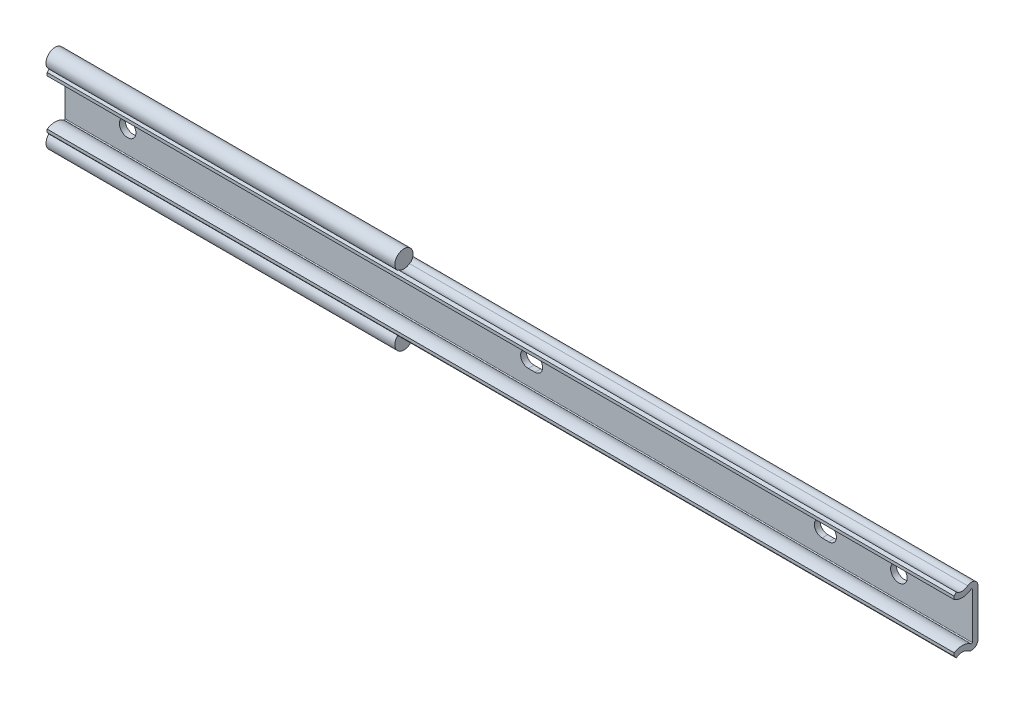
ISO-10303-21;
HEADER;
FILE_DESCRIPTION(('STEP AP214'),'2;1');
FILE_NAME('part.step','',(''),(''),'','','');
FILE_SCHEMA(('AUTOMOTIVE_DESIGN { 1 0 10303 214 1 1 1 1 }'));
ENDSEC;
DATA;
#1=APPLICATION_CONTEXT('core data for automotive mechanical design processes');
#2=APPLICATION_PROTOCOL_DEFINITION('international standard','automotive_design',2000,#1);
#3=PRODUCT_CONTEXT('',#1,'mechanical');
#4=PRODUCT('Part','Part','',(#3));
#5=PRODUCT_RELATED_PRODUCT_CATEGORY('part','',(#4));
#6=PRODUCT_DEFINITION_FORMATION('','',#4);
#7=PRODUCT_DEFINITION_CONTEXT('part definition',#1,'design');
#8=PRODUCT_DEFINITION('design','',#6,#7);
#9=PRODUCT_DEFINITION_SHAPE('','',#8);
#10=(LENGTH_UNIT() NAMED_UNIT(*) SI_UNIT(.MILLI.,.METRE.));
#11=(NAMED_UNIT(*) PLANE_ANGLE_UNIT() SI_UNIT($,.RADIAN.));
#12=(NAMED_UNIT(*) SI_UNIT($,.STERADIAN.) SOLID_ANGLE_UNIT());
#13=UNCERTAINTY_MEASURE_WITH_UNIT(LENGTH_MEASURE(1.E-05),#10,'distance_accuracy_value','');
#14=(GEOMETRIC_REPRESENTATION_CONTEXT(3) GLOBAL_UNCERTAINTY_ASSIGNED_CONTEXT((#13)) GLOBAL_UNIT_ASSIGNED_CONTEXT((#10,
#11,#12)) REPRESENTATION_CONTEXT('',''));
#15=CARTESIAN_POINT('',(0.,0.,0.));
#16=DIRECTION('',(0.,0.,1.));
#17=DIRECTION('',(1.,0.,0.));
#18=AXIS2_PLACEMENT_3D('',#15,#16,#17);
#19=CARTESIAN_POINT('',(230.,9.66999972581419,4.3099999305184));
#20=DIRECTION('',(-1.,0.,0.));
#21=DIRECTION('',(0.,0.,1.));
#22=AXIS2_PLACEMENT_3D('',#19,#20,#21);
#23=CYLINDRICAL_SURFACE('',#22,2.48000011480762);
#24=CARTESIAN_POINT('',(78.,9.66999972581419,4.3099999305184));
#25=DIRECTION('',(-1.,0.,0.));
#26=DIRECTION('',(0.,0.,1.));
#27=AXIS2_PLACEMENT_3D('',#24,#25,#26);
#28=CIRCLE('',#27,2.48000011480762);
#29=CARTESIAN_POINT('',(78.,7.77020940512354,5.90411325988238));
#30=VERTEX_POINT('',#29);
#31=CARTESIAN_POINT('',(78.,7.69573912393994,2.80910165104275));
#32=VERTEX_POINT('',#31);
#33=EDGE_CURVE('E228',#30,#32,#28,.F.);
#34=ORIENTED_EDGE('',*,*,#33,.F.);
#35=DIRECTION('',(-1.,0.,0.));
#36=VECTOR('',#35,1.);
#37=CARTESIAN_POINT('',(230.,7.77020940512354,5.90411325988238));
#38=LINE('',#37,#36);
#39=CARTESIAN_POINT('',(230.,7.77020940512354,5.90411325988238));
#40=VERTEX_POINT('',#39);
#41=EDGE_CURVE('E350',#40,#30,#38,.T.);
#42=ORIENTED_EDGE('',*,*,#41,.F.);
#43=CARTESIAN_POINT('',(230.,9.66999972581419,4.3099999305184));
#44=DIRECTION('',(-1.,0.,0.));
#45=DIRECTION('',(0.,0.,-1.));
#46=AXIS2_PLACEMENT_3D('',#43,#44,#45);
#47=CIRCLE('',#46,2.48000011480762);
#48=CARTESIAN_POINT('',(230.,7.69573912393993,2.80910165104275));
#49=VERTEX_POINT('',#48);
#50=EDGE_CURVE('E324',#49,#40,#47,.T.);
#51=ORIENTED_EDGE('',*,*,#50,.F.);
#52=DIRECTION('',(-1.,0.,0.));
#53=VECTOR('',#52,1.);
#54=CARTESIAN_POINT('',(230.,7.69573912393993,2.80910165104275));
#55=LINE('',#54,#53);
#56=EDGE_CURVE('E353',#49,#32,#55,.T.);
#57=ORIENTED_EDGE('',*,*,#56,.T.);
#58=EDGE_LOOP('',(#34,#42,#51,#57));
#59=FACE_BOUND('',#58,.T.);
#60=ADVANCED_FACE('F14',(#59),#23,.F.);
#61=CARTESIAN_POINT('',(230.,-9.66999990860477,4.3099999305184));
#62=DIRECTION('',(-1.,0.,0.));
#63=DIRECTION('',(0.,0.,1.));
#64=AXIS2_PLACEMENT_3D('',#61,#62,#63);
#65=CYLINDRICAL_SURFACE('',#64,4.03000011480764);
#66=DIRECTION('',(-1.,0.,0.));
#67=VECTOR('',#66,1.);
#68=CARTESIAN_POINT('',(230.,-6.46182654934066,1.87104018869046));
#69=LINE('',#68,#67);
#70=CARTESIAN_POINT('',(230.,-6.46182654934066,1.87104018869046));
#71=VERTEX_POINT('',#70);
#72=CARTESIAN_POINT('',(-17.,-6.46182654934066,1.87104018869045));
#73=VERTEX_POINT('',#72);
#74=EDGE_CURVE('E338',#71,#73,#69,.T.);
#75=ORIENTED_EDGE('',*,*,#74,.T.);
#76=CARTESIAN_POINT('',(-17.,-9.66999990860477,4.3099999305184));
#77=DIRECTION('',(-1.,0.,0.));
#78=DIRECTION('',(0.,0.,1.));
#79=AXIS2_PLACEMENT_3D('',#76,#77,#78);
#80=CIRCLE('',#79,4.03000011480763);
#81=CARTESIAN_POINT('',(-17.,-6.26775055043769,6.4699999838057));
#82=VERTEX_POINT('',#81);
#83=EDGE_CURVE('E232',#82,#73,#80,.T.);
#84=ORIENTED_EDGE('',*,*,#83,.F.);
#85=DIRECTION('',(-1.,0.,0.));
#86=VECTOR('',#85,1.);
#87=CARTESIAN_POINT('',(230.,-6.26775055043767,6.46999998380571));
#88=LINE('',#87,#86);
#89=CARTESIAN_POINT('',(230.,-6.26775055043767,6.46999998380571));
#90=VERTEX_POINT('',#89);
#91=EDGE_CURVE('E368',#90,#82,#88,.T.);
#92=ORIENTED_EDGE('',*,*,#91,.F.);
#93=CARTESIAN_POINT('',(230.,-9.66999990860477,4.3099999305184));
#94=DIRECTION('',(1.,0.,0.));
#95=DIRECTION('',(0.,0.,1.));
#96=AXIS2_PLACEMENT_3D('',#93,#94,#95);
#97=CIRCLE('',#96,4.03000011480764);
#98=EDGE_CURVE('E309',#71,#90,#97,.T.);
#99=ORIENTED_EDGE('',*,*,#98,.F.);
#100=EDGE_LOOP('',(#75,#84,#92,#99));
#101=FACE_BOUND('',#100,.T.);
#102=ADVANCED_FACE('F16',(#101),#65,.T.);
#103=CARTESIAN_POINT('',(230.,-6.26775055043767,6.46999998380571));
#104=DIRECTION('',(0.,0.,-1.));
#105=DIRECTION('',(-1.,0.,0.));
#106=AXIS2_PLACEMENT_3D('',#103,#104,#105);
#107=PLANE('',#106);
#108=ORIENTED_EDGE('',*,*,#91,.T.);
#109=DIRECTION('',(0.,1.,0.));
#110=VECTOR('',#109,1.);
#111=CARTESIAN_POINT('',(-17.,-7.09581181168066,6.46999998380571));
#112=LINE('',#111,#110);
#113=CARTESIAN_POINT('',(-17.,-7.09581181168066,6.46999998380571));
#114=VERTEX_POINT('',#113);
#115=EDGE_CURVE('E262',#114,#82,#112,.T.);
#116=ORIENTED_EDGE('',*,*,#115,.F.);
#117=DIRECTION('',(-1.,0.,0.));
#118=VECTOR('',#117,1.);
#119=CARTESIAN_POINT('',(230.,-7.09581181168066,6.46999998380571));
#120=LINE('',#119,#118);
#121=CARTESIAN_POINT('',(230.,-7.09581181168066,6.46999998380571));
#122=VERTEX_POINT('',#121);
#123=EDGE_CURVE('E366',#122,#114,#120,.T.);
#124=ORIENTED_EDGE('',*,*,#123,.F.);
#125=DIRECTION('',(0.,-1.,0.));
#126=VECTOR('',#125,1.);
#127=CARTESIAN_POINT('',(230.,-6.26775055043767,6.46999998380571));
#128=LINE('',#127,#126);
#129=EDGE_CURVE('E312',#90,#122,#128,.T.);
#130=ORIENTED_EDGE('',*,*,#129,.F.);
#131=EDGE_LOOP('',(#108,#116,#124,#130));
#132=FACE_BOUND('',#131,.T.);
#133=ADVANCED_FACE('F456',(#132),#107,.F.);
#134=CARTESIAN_POINT('',(230.,-7.77020958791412,5.90411325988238));
#135=DIRECTION('',(0.,0.642787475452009,-0.766044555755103));
#136=DIRECTION('',(0.,0.766044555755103,0.642787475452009));
#137=AXIS2_PLACEMENT_3D('',#134,#135,#136);
#138=PLANE('',#137);
#139=DIRECTION('',(0.,0.7660445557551,0.642787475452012));
#140=VECTOR('',#139,1.);
#141=CARTESIAN_POINT('',(-17.,-7.77020958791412,5.90411325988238));
#142=LINE('',#141,#140);
#143=CARTESIAN_POINT('',(-17.,-7.65539913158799,6.00045063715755));
#144=VERTEX_POINT('',#143);
#145=EDGE_CURVE('E211',#144,#114,#142,.T.);
#146=ORIENTED_EDGE('',*,*,#145,.F.);
#147=DIRECTION('',(-1.,0.,0.));
#148=VECTOR('',#147,1.);
#149=CARTESIAN_POINT('',(78.,-7.65539913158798,6.00045063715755));
#150=LINE('',#149,#148);
#151=CARTESIAN_POINT('',(78.,-7.65539913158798,6.00045063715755));
#152=VERTEX_POINT('',#151);
#153=EDGE_CURVE('E202',#144,#152,#150,.F.);
#154=ORIENTED_EDGE('',*,*,#153,.T.);
#155=DIRECTION('',(0.,-0.766044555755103,-0.642787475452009));
#156=VECTOR('',#155,1.);
#157=CARTESIAN_POINT('',(78.,-7.77020958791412,5.90411325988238));
#158=LINE('',#157,#156);
#159=CARTESIAN_POINT('',(78.,-7.77020958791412,5.90411325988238));
#160=VERTEX_POINT('',#159);
#161=EDGE_CURVE('E188',#152,#160,#158,.T.);
#162=ORIENTED_EDGE('',*,*,#161,.T.);
#163=DIRECTION('',(-1.,0.,0.));
#164=VECTOR('',#163,1.);
#165=CARTESIAN_POINT('',(230.,-7.77020958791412,5.90411325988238));
#166=LINE('',#165,#164);
#167=CARTESIAN_POINT('',(230.,-7.77020958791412,5.90411325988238));
#168=VERTEX_POINT('',#167);
#169=EDGE_CURVE('E364',#168,#160,#166,.T.);
#170=ORIENTED_EDGE('',*,*,#169,.F.);
#171=DIRECTION('',(0.,-0.766044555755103,-0.642787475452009));
#172=VECTOR('',#171,1.);
#173=CARTESIAN_POINT('',(230.,-7.77020958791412,5.90411325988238));
#174=LINE('',#173,#172);
#175=EDGE_CURVE('E314',#122,#168,#174,.T.);
#176=ORIENTED_EDGE('',*,*,#175,.F.);
#177=ORIENTED_EDGE('',*,*,#123,.T.);
#178=EDGE_LOOP('',(#146,#154,#162,#170,#176,#177));
#179=FACE_BOUND('',#178,.T.);
#180=ADVANCED_FACE('F209',(#179),#138,.F.);
#181=CARTESIAN_POINT('',(230.,-9.66999990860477,4.3099999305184));
#182=DIRECTION('',(-1.,0.,0.));
#183=DIRECTION('',(0.,0.,1.));
#184=AXIS2_PLACEMENT_3D('',#181,#182,#183);
#185=CYLINDRICAL_SURFACE('',#184,2.48000011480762);
#186=ORIENTED_EDGE('',*,*,#169,.T.);
#187=CARTESIAN_POINT('',(78.,-9.66999990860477,4.3099999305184));
#188=DIRECTION('',(1.,0.,0.));
#189=DIRECTION('',(0.,0.,-1.));
#190=AXIS2_PLACEMENT_3D('',#187,#188,#189);
#191=CIRCLE('',#190,2.48000011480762);
#192=CARTESIAN_POINT('',(78.,-7.69573930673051,2.80910165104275));
#193=VERTEX_POINT('',#192);
#194=EDGE_CURVE('E193',#160,#193,#191,.F.);
#195=ORIENTED_EDGE('',*,*,#194,.T.);
#196=DIRECTION('',(-1.,0.,0.));
#197=VECTOR('',#196,1.);
#198=CARTESIAN_POINT('',(230.,-7.69573930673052,2.80910165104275));
#199=LINE('',#198,#197);
#200=CARTESIAN_POINT('',(230.,-7.69573930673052,2.80910165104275));
#201=VERTEX_POINT('',#200);
#202=EDGE_CURVE('E361',#201,#193,#199,.T.);
#203=ORIENTED_EDGE('',*,*,#202,.F.);
#204=CARTESIAN_POINT('',(230.,-9.66999990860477,4.3099999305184));
#205=DIRECTION('',(-1.,0.,0.));
#206=DIRECTION('',(0.,0.,1.));
#207=AXIS2_PLACEMENT_3D('',#204,#205,#206);
#208=CIRCLE('',#207,2.48000011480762);
#209=EDGE_CURVE('E316',#168,#201,#208,.T.);
#210=ORIENTED_EDGE('',*,*,#209,.F.);
#211=EDGE_LOOP('',(#186,#195,#203,#210));
#212=FACE_BOUND('',#211,.T.);
#213=ADVANCED_FACE('F463',(#212),#185,.F.);
#214=CARTESIAN_POINT('',(230.,-6.302612,1.74999999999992));
#215=DIRECTION('',(-1.,0.,0.));
#216=DIRECTION('',(0.,0.,1.));
#217=AXIS2_PLACEMENT_3D('',#214,#215,#216);
#218=CYLINDRICAL_SURFACE('',#217,1.74999999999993);
#219=CARTESIAN_POINT('',(78.,-6.302612,1.74999999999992));
#220=DIRECTION('',(1.,0.,0.));
#221=DIRECTION('',(0.,0.,-1.));
#222=AXIS2_PLACEMENT_3D('',#219,#220,#221);
#223=CIRCLE('',#222,1.74999999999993);
#224=CARTESIAN_POINT('',(78.,-7.94495173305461,2.35433451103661));
#225=VERTEX_POINT('',#224);
#226=EDGE_CURVE('E9',#193,#225,#223,.T.);
#227=ORIENTED_EDGE('',*,*,#226,.T.);
#228=DIRECTION('',(-1.,0.,0.));
#229=VECTOR('',#228,1.);
#230=CARTESIAN_POINT('',(30.5,-7.94495173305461,2.35433451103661));
#231=LINE('',#230,#229);
#232=CARTESIAN_POINT('',(-17.,-7.94495173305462,2.3543345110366));
#233=VERTEX_POINT('',#232);
#234=EDGE_CURVE('E205',#225,#233,#231,.T.);
#235=ORIENTED_EDGE('',*,*,#234,.T.);
#236=CARTESIAN_POINT('',(-17.,-6.302612,1.74999999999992));
#237=DIRECTION('',(-1.,0.,0.));
#238=DIRECTION('',(0.,0.,1.));
#239=AXIS2_PLACEMENT_3D('',#236,#237,#238);
#240=CIRCLE('',#239,1.74999999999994);
#241=CARTESIAN_POINT('',(-17.,-6.302612,0.));
#242=VERTEX_POINT('',#241);
#243=EDGE_CURVE('E258',#242,#233,#240,.T.);
#244=ORIENTED_EDGE('',*,*,#243,.F.);
#245=DIRECTION('',(-1.,0.,0.));
#246=VECTOR('',#245,1.);
#247=CARTESIAN_POINT('',(230.,-6.302612,0.));
#248=LINE('',#247,#246);
#249=CARTESIAN_POINT('',(230.,-6.302612,0.));
#250=VERTEX_POINT('',#249);
#251=EDGE_CURVE('E359',#250,#242,#248,.T.);
#252=ORIENTED_EDGE('',*,*,#251,.F.);
#253=CARTESIAN_POINT('',(230.,-6.302612,1.74999999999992));
#254=DIRECTION('',(1.,0.,0.));
#255=DIRECTION('',(0.,0.,1.));
#256=AXIS2_PLACEMENT_3D('',#253,#254,#255);
#257=CIRCLE('',#256,1.74999999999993);
#258=EDGE_CURVE('E318',#201,#250,#257,.T.);
#259=ORIENTED_EDGE('',*,*,#258,.F.);
#260=ORIENTED_EDGE('',*,*,#202,.T.);
#261=EDGE_LOOP('',(#227,#235,#244,#252,#259,#260));
#262=FACE_BOUND('',#261,.T.);
#263=ADVANCED_FACE('F465',(#262),#218,.T.);
#264=CARTESIAN_POINT('',(230.,-6.302612,0.));
#265=DIRECTION('',(0.,0.,1.));
#266=DIRECTION('',(1.,0.,0.));
#267=AXIS2_PLACEMENT_3D('',#264,#265,#266);
#268=PLANE('',#267);
#269=DIRECTION('',(-1.,0.,0.));
#270=VECTOR('',#269,1.);
#271=CARTESIAN_POINT('',(110.9,-2.1,0.));
#272=LINE('',#271,#270);
#273=CARTESIAN_POINT('',(110.9,-2.1,0.));
#274=VERTEX_POINT('',#273);
#275=CARTESIAN_POINT('',(109.1,-2.1,0.));
#276=VERTEX_POINT('',#275);
#277=EDGE_CURVE('E266',#274,#276,#272,.T.);
#278=ORIENTED_EDGE('',*,*,#277,.F.);
#279=CARTESIAN_POINT('',(110.9,0.,0.));
#280=DIRECTION('',(0.,0.,-1.));
#281=DIRECTION('',(-1.,0.,0.));
#282=AXIS2_PLACEMENT_3D('',#279,#280,#281);
#283=CIRCLE('',#282,2.1);
#284=CARTESIAN_POINT('',(110.9,2.1,0.));
#285=VERTEX_POINT('',#284);
#286=EDGE_CURVE('E29',#285,#274,#283,.T.);
#287=ORIENTED_EDGE('',*,*,#286,.F.);
#288=DIRECTION('',(1.,0.,0.));
#289=VECTOR('',#288,1.);
#290=CARTESIAN_POINT('',(110.9,2.1,0.));
#291=LINE('',#290,#289);
#292=CARTESIAN_POINT('',(109.1,2.1,0.));
#293=VERTEX_POINT('',#292);
#294=EDGE_CURVE('E271',#293,#285,#291,.T.);
#295=ORIENTED_EDGE('',*,*,#294,.F.);
#296=CARTESIAN_POINT('',(109.1,0.,0.));
#297=DIRECTION('',(0.,0.,-1.));
#298=DIRECTION('',(-1.,0.,0.));
#299=AXIS2_PLACEMENT_3D('',#296,#297,#298);
#300=CIRCLE('',#299,2.1);
#301=EDGE_CURVE('E268',#276,#293,#300,.T.);
#302=ORIENTED_EDGE('',*,*,#301,.F.);
#303=EDGE_LOOP('',(#278,#287,#295,#302));
#304=FACE_BOUND('',#303,.T.);
#305=DIRECTION('',(-1.,0.,0.));
#306=VECTOR('',#305,1.);
#307=CARTESIAN_POINT('',(190.9,-2.1,0.));
#308=LINE('',#307,#306);
#309=CARTESIAN_POINT('',(190.9,-2.1,0.));
#310=VERTEX_POINT('',#309);
#311=CARTESIAN_POINT('',(189.1,-2.1,0.));
#312=VERTEX_POINT('',#311);
#313=EDGE_CURVE('E283',#310,#312,#308,.T.);
#314=ORIENTED_EDGE('',*,*,#313,.F.);
#315=CARTESIAN_POINT('',(190.9,0.,0.));
#316=DIRECTION('',(0.,0.,-1.));
#317=DIRECTION('',(-1.,0.,0.));
#318=AXIS2_PLACEMENT_3D('',#315,#316,#317);
#319=CIRCLE('',#318,2.1);
#320=CARTESIAN_POINT('',(190.9,2.1,0.));
#321=VERTEX_POINT('',#320);
#322=EDGE_CURVE('E277',#321,#310,#319,.T.);
#323=ORIENTED_EDGE('',*,*,#322,.F.);
#324=DIRECTION('',(1.,0.,0.));
#325=VECTOR('',#324,1.);
#326=CARTESIAN_POINT('',(190.9,2.1,0.));
#327=LINE('',#326,#325);
#328=CARTESIAN_POINT('',(189.1,2.1,0.));
#329=VERTEX_POINT('',#328);
#330=EDGE_CURVE('E289',#329,#321,#327,.T.);
#331=ORIENTED_EDGE('',*,*,#330,.F.);
#332=CARTESIAN_POINT('',(189.1,0.,0.));
#333=DIRECTION('',(0.,0.,-1.));
#334=DIRECTION('',(-1.,0.,0.));
#335=AXIS2_PLACEMENT_3D('',#332,#333,#334);
#336=CIRCLE('',#335,2.1);
#337=EDGE_CURVE('E286',#312,#329,#336,.T.);
#338=ORIENTED_EDGE('',*,*,#337,.F.);
#339=EDGE_LOOP('',(#314,#323,#331,#338));
#340=FACE_BOUND('',#339,.T.);
#341=CARTESIAN_POINT('',(210.,0.,0.));
#342=DIRECTION('',(0.,0.,-1.));
#343=DIRECTION('',(-1.,0.,0.));
#344=AXIS2_PLACEMENT_3D('',#341,#342,#343);
#345=CIRCLE('',#344,2.25);
#346=CARTESIAN_POINT('',(207.75,0.,0.));
#347=VERTEX_POINT('',#346);
#348=EDGE_CURVE('E295',#347,#347,#345,.T.);
#349=ORIENTED_EDGE('',*,*,#348,.F.);
#350=EDGE_LOOP('',(#349));
#351=FACE_BOUND('',#350,.T.);
#352=CARTESIAN_POINT('',(0.,0.,0.));
#353=DIRECTION('',(0.,0.,-1.));
#354=DIRECTION('',(-1.,0.,0.));
#355=AXIS2_PLACEMENT_3D('',#352,#353,#354);
#356=CIRCLE('',#355,2.24999999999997);
#357=CARTESIAN_POINT('',(-2.24999999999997,0.,0.));
#358=VERTEX_POINT('',#357);
#359=EDGE_CURVE('E305',#358,#358,#356,.T.);
#360=ORIENTED_EDGE('',*,*,#359,.F.);
#361=EDGE_LOOP('',(#360));
#362=FACE_BOUND('',#361,.T.);
#363=ORIENTED_EDGE('',*,*,#251,.T.);
#364=DIRECTION('',(0.,-1.,0.));
#365=VECTOR('',#364,1.);
#366=CARTESIAN_POINT('',(-17.,6.30261181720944,0.));
#367=LINE('',#366,#365);
#368=CARTESIAN_POINT('',(-17.,6.30261181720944,0.));
#369=VERTEX_POINT('',#368);
#370=EDGE_CURVE('E255',#369,#242,#367,.T.);
#371=ORIENTED_EDGE('',*,*,#370,.F.);
#372=DIRECTION('',(-1.,0.,0.));
#373=VECTOR('',#372,1.);
#374=CARTESIAN_POINT('',(230.,6.30261181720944,0.));
#375=LINE('',#374,#373);
#376=CARTESIAN_POINT('',(230.,6.30261181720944,0.));
#377=VERTEX_POINT('',#376);
#378=EDGE_CURVE('E356',#377,#369,#375,.T.);
#379=ORIENTED_EDGE('',*,*,#378,.F.);
#380=DIRECTION('',(0.,1.,0.));
#381=VECTOR('',#380,1.);
#382=CARTESIAN_POINT('',(230.,-6.302612,0.));
#383=LINE('',#382,#381);
#384=EDGE_CURVE('E320',#250,#377,#383,.T.);
#385=ORIENTED_EDGE('',*,*,#384,.F.);
#386=EDGE_LOOP('',(#363,#371,#379,#385));
#387=FACE_BOUND('',#386,.T.);
#388=ADVANCED_FACE('F469',(#304,#340,#351,#362,#387),#268,.F.);
#389=CARTESIAN_POINT('',(230.,6.30261181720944,1.74999999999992));
#390=DIRECTION('',(-1.,0.,0.));
#391=DIRECTION('',(0.,0.,1.));
#392=AXIS2_PLACEMENT_3D('',#389,#390,#391);
#393=CYLINDRICAL_SURFACE('',#392,1.74999999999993);
#394=CARTESIAN_POINT('',(-17.,6.30261181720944,1.74999999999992));
#395=DIRECTION('',(-1.,0.,0.));
#396=DIRECTION('',(0.,0.,1.));
#397=AXIS2_PLACEMENT_3D('',#394,#395,#396);
#398=CIRCLE('',#397,1.74999999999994);
#399=CARTESIAN_POINT('',(-17.,7.94495155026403,2.3543345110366));
#400=VERTEX_POINT('',#399);
#401=EDGE_CURVE('E253',#400,#369,#398,.T.);
#402=ORIENTED_EDGE('',*,*,#401,.F.);
#403=DIRECTION('',(-1.,0.,0.));
#404=VECTOR('',#403,1.);
#405=CARTESIAN_POINT('',(30.5,7.94495155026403,2.35433451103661));
#406=LINE('',#405,#404);
#407=CARTESIAN_POINT('',(78.,7.94495155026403,2.35433451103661));
#408=VERTEX_POINT('',#407);
#409=EDGE_CURVE('E225',#400,#408,#406,.F.);
#410=ORIENTED_EDGE('',*,*,#409,.T.);
#411=CARTESIAN_POINT('',(78.,6.30261181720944,1.74999999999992));
#412=DIRECTION('',(-1.,0.,0.));
#413=DIRECTION('',(0.,0.,1.));
#414=AXIS2_PLACEMENT_3D('',#411,#412,#413);
#415=CIRCLE('',#414,1.74999999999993);
#416=EDGE_CURVE('E230',#32,#408,#415,.T.);
#417=ORIENTED_EDGE('',*,*,#416,.F.);
#418=ORIENTED_EDGE('',*,*,#56,.F.);
#419=CARTESIAN_POINT('',(230.,6.30261181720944,1.74999999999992));
#420=DIRECTION('',(1.,0.,0.));
#421=DIRECTION('',(0.,0.,-1.));
#422=AXIS2_PLACEMENT_3D('',#419,#420,#421);
#423=CIRCLE('',#422,1.74999999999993);
#424=EDGE_CURVE('E322',#377,#49,#423,.T.);
#425=ORIENTED_EDGE('',*,*,#424,.F.);
#426=ORIENTED_EDGE('',*,*,#378,.T.);
#427=EDGE_LOOP('',(#402,#410,#417,#418,#425,#426));
#428=FACE_BOUND('',#427,.T.);
#429=ADVANCED_FACE('F421',(#428),#393,.T.);
#430=CARTESIAN_POINT('',(230.,7.77020940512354,5.90411325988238));
#431=DIRECTION('',(0.,-0.642787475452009,-0.766044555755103));
#432=DIRECTION('',(0.,0.766044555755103,-0.642787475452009));
#433=AXIS2_PLACEMENT_3D('',#430,#431,#432);
#434=PLANE('',#433);
#435=DIRECTION('',(0.,0.766044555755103,-0.642787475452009));
#436=VECTOR('',#435,1.);
#437=CARTESIAN_POINT('',(78.,7.77020940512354,5.90411325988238));
#438=LINE('',#437,#436);
#439=CARTESIAN_POINT('',(78.,7.6553989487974,6.00045063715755));
#440=VERTEX_POINT('',#439);
#441=EDGE_CURVE('E22',#440,#30,#438,.T.);
#442=ORIENTED_EDGE('',*,*,#441,.F.);
#443=DIRECTION('',(-1.,0.,0.));
#444=VECTOR('',#443,1.);
#445=CARTESIAN_POINT('',(78.,7.6553989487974,6.00045063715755));
#446=LINE('',#445,#444);
#447=CARTESIAN_POINT('',(-17.,7.6553989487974,6.00045063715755));
#448=VERTEX_POINT('',#447);
#449=EDGE_CURVE('E220',#440,#448,#446,.T.);
#450=ORIENTED_EDGE('',*,*,#449,.T.);
#451=DIRECTION('',(0.,0.7660445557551,-0.642787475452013));
#452=VECTOR('',#451,1.);
#453=CARTESIAN_POINT('',(-17.,7.09581162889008,6.46999998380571));
#454=LINE('',#453,#452);
#455=CARTESIAN_POINT('',(-17.,7.09581162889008,6.46999998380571));
#456=VERTEX_POINT('',#455);
#457=EDGE_CURVE('E250',#456,#448,#454,.T.);
#458=ORIENTED_EDGE('',*,*,#457,.F.);
#459=DIRECTION('',(-1.,0.,0.));
#460=VECTOR('',#459,1.);
#461=CARTESIAN_POINT('',(230.,7.09581162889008,6.46999998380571));
#462=LINE('',#461,#460);
#463=CARTESIAN_POINT('',(230.,7.09581162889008,6.46999998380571));
#464=VERTEX_POINT('',#463);
#465=EDGE_CURVE('E348',#464,#456,#462,.T.);
#466=ORIENTED_EDGE('',*,*,#465,.F.);
#467=DIRECTION('',(0.,-0.766044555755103,0.642787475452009));
#468=VECTOR('',#467,1.);
#469=CARTESIAN_POINT('',(230.,7.77020940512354,5.90411325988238));
#470=LINE('',#469,#468);
#471=EDGE_CURVE('E326',#40,#464,#470,.T.);
#472=ORIENTED_EDGE('',*,*,#471,.F.);
#473=ORIENTED_EDGE('',*,*,#41,.T.);
#474=EDGE_LOOP('',(#442,#450,#458,#466,#472,#473));
#475=FACE_BOUND('',#474,.T.);
#476=ADVANCED_FACE('F409',(#475),#434,.F.);
#477=CARTESIAN_POINT('',(230.,6.26775036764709,6.46999998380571));
#478=DIRECTION('',(0.,0.,-1.));
#479=DIRECTION('',(-1.,0.,0.));
#480=AXIS2_PLACEMENT_3D('',#477,#478,#479);
#481=PLANE('',#480);
#482=ORIENTED_EDGE('',*,*,#465,.T.);
#483=DIRECTION('',(0.,1.,0.));
#484=VECTOR('',#483,1.);
#485=CARTESIAN_POINT('',(-17.,6.26775036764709,6.46999998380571));
#486=LINE('',#485,#484);
#487=CARTESIAN_POINT('',(-17.,6.26775036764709,6.46999998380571));
#488=VERTEX_POINT('',#487);
#489=EDGE_CURVE('E247',#488,#456,#486,.T.);
#490=ORIENTED_EDGE('',*,*,#489,.F.);
#491=DIRECTION('',(-1.,0.,0.));
#492=VECTOR('',#491,1.);
#493=CARTESIAN_POINT('',(230.,6.26775036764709,6.46999998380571));
#494=LINE('',#493,#492);
#495=CARTESIAN_POINT('',(230.,6.26775036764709,6.46999998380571));
#496=VERTEX_POINT('',#495);
#497=EDGE_CURVE('E346',#496,#488,#494,.T.);
#498=ORIENTED_EDGE('',*,*,#497,.F.);
#499=DIRECTION('',(0.,-1.,0.));
#500=VECTOR('',#499,1.);
#501=CARTESIAN_POINT('',(230.,6.26775036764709,6.46999998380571));
#502=LINE('',#501,#500);
#503=EDGE_CURVE('E328',#464,#496,#502,.T.);
#504=ORIENTED_EDGE('',*,*,#503,.F.);
#505=EDGE_LOOP('',(#482,#490,#498,#504));
#506=FACE_BOUND('',#505,.T.);
#507=ADVANCED_FACE('F429',(#506),#481,.F.);
#508=CARTESIAN_POINT('',(230.,9.66999972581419,4.3099999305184));
#509=DIRECTION('',(-1.,0.,0.));
#510=DIRECTION('',(0.,0.,1.));
#511=AXIS2_PLACEMENT_3D('',#508,#509,#510);
#512=CYLINDRICAL_SURFACE('',#511,4.03000011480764);
#513=ORIENTED_EDGE('',*,*,#497,.T.);
#514=CARTESIAN_POINT('',(-17.,9.66999972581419,4.3099999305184));
#515=DIRECTION('',(-1.,0.,0.));
#516=DIRECTION('',(0.,0.,1.));
#517=AXIS2_PLACEMENT_3D('',#514,#515,#516);
#518=CIRCLE('',#517,4.03000011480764);
#519=CARTESIAN_POINT('',(-17.,6.46182636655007,1.87104018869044));
#520=VERTEX_POINT('',#519);
#521=EDGE_CURVE('E244',#520,#488,#518,.T.);
#522=ORIENTED_EDGE('',*,*,#521,.F.);
#523=DIRECTION('',(-1.,0.,0.));
#524=VECTOR('',#523,1.);
#525=CARTESIAN_POINT('',(230.,6.46182636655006,1.87104018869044));
#526=LINE('',#525,#524);
#527=CARTESIAN_POINT('',(230.,6.46182636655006,1.87104018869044));
#528=VERTEX_POINT('',#527);
#529=EDGE_CURVE('E344',#528,#520,#526,.T.);
#530=ORIENTED_EDGE('',*,*,#529,.F.);
#531=CARTESIAN_POINT('',(230.,9.66999972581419,4.3099999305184));
#532=DIRECTION('',(1.,0.,0.));
#533=DIRECTION('',(0.,0.,-1.));
#534=AXIS2_PLACEMENT_3D('',#531,#532,#533);
#535=CIRCLE('',#534,4.03000011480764);
#536=EDGE_CURVE('E330',#496,#528,#535,.T.);
#537=ORIENTED_EDGE('',*,*,#536,.F.);
#538=EDGE_LOOP('',(#513,#522,#530,#537));
#539=FACE_BOUND('',#538,.T.);
#540=ADVANCED_FACE('F433',(#539),#512,.T.);
#541=CARTESIAN_POINT('',(230.,6.30261181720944,1.74999999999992));
#542=DIRECTION('',(-1.,0.,0.));
#543=DIRECTION('',(0.,0.,1.));
#544=AXIS2_PLACEMENT_3D('',#541,#542,#543);
#545=CYLINDRICAL_SURFACE('',#544,0.199999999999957);
#546=ORIENTED_EDGE('',*,*,#529,.T.);
#547=CARTESIAN_POINT('',(-17.,6.30261181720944,1.74999999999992));
#548=DIRECTION('',(1.,0.,0.));
#549=DIRECTION('',(0.,0.,1.));
#550=AXIS2_PLACEMENT_3D('',#547,#548,#549);
#551=CIRCLE('',#550,0.199999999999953);
#552=CARTESIAN_POINT('',(-17.,6.30261181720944,1.54999999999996));
#553=VERTEX_POINT('',#552);
#554=EDGE_CURVE('E241',#553,#520,#551,.T.);
#555=ORIENTED_EDGE('',*,*,#554,.F.);
#556=DIRECTION('',(-1.,0.,0.));
#557=VECTOR('',#556,1.);
#558=CARTESIAN_POINT('',(230.,6.30261181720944,1.54999999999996));
#559=LINE('',#558,#557);
#560=CARTESIAN_POINT('',(230.,6.30261181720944,1.54999999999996));
#561=VERTEX_POINT('',#560);
#562=EDGE_CURVE('E342',#561,#553,#559,.T.);
#563=ORIENTED_EDGE('',*,*,#562,.F.);
#564=CARTESIAN_POINT('',(230.,6.30261181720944,1.74999999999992));
#565=DIRECTION('',(-1.,0.,0.));
#566=DIRECTION('',(0.,0.,-1.));
#567=AXIS2_PLACEMENT_3D('',#564,#565,#566);
#568=CIRCLE('',#567,0.199999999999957);
#569=EDGE_CURVE('E332',#528,#561,#568,.T.);
#570=ORIENTED_EDGE('',*,*,#569,.F.);
#571=EDGE_LOOP('',(#546,#555,#563,#570));
#572=FACE_BOUND('',#571,.T.);
#573=ADVANCED_FACE('F440',(#572),#545,.F.);
#574=CARTESIAN_POINT('',(230.,-6.302612,1.54999999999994));
#575=DIRECTION('',(0.,0.,-1.));
#576=DIRECTION('',(-1.,0.,0.));
#577=AXIS2_PLACEMENT_3D('',#574,#575,#576);
#578=PLANE('',#577);
#579=DIRECTION('',(1.,0.,0.));
#580=VECTOR('',#579,1.);
#581=CARTESIAN_POINT('',(230.,2.1,1.54999999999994));
#582=LINE('',#581,#580);
#583=CARTESIAN_POINT('',(109.1,2.1,1.54999999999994));
#584=VERTEX_POINT('',#583);
#585=CARTESIAN_POINT('',(110.9,2.1,1.54999999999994));
#586=VERTEX_POINT('',#585);
#587=EDGE_CURVE('E392',#584,#586,#582,.T.);
#588=ORIENTED_EDGE('',*,*,#587,.T.);
#589=CARTESIAN_POINT('',(110.9,0.,1.54999999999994));
#590=DIRECTION('',(0.,0.,-1.));
#591=DIRECTION('',(-1.,0.,0.));
#592=AXIS2_PLACEMENT_3D('',#589,#590,#591);
#593=CIRCLE('',#592,2.1);
#594=CARTESIAN_POINT('',(110.9,-2.1,1.54999999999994));
#595=VERTEX_POINT('',#594);
#596=EDGE_CURVE('E395',#586,#595,#593,.T.);
#597=ORIENTED_EDGE('',*,*,#596,.T.);
#598=DIRECTION('',(-1.,0.,0.));
#599=VECTOR('',#598,1.);
#600=CARTESIAN_POINT('',(230.,-2.1,1.54999999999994));
#601=LINE('',#600,#599);
#602=CARTESIAN_POINT('',(109.1,-2.1,1.54999999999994));
#603=VERTEX_POINT('',#602);
#604=EDGE_CURVE('E386',#595,#603,#601,.T.);
#605=ORIENTED_EDGE('',*,*,#604,.T.);
#606=CARTESIAN_POINT('',(109.1,0.,1.54999999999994));
#607=DIRECTION('',(0.,0.,-1.));
#608=DIRECTION('',(-1.,0.,0.));
#609=AXIS2_PLACEMENT_3D('',#606,#607,#608);
#610=CIRCLE('',#609,2.1);
#611=EDGE_CURVE('E389',#603,#584,#610,.T.);
#612=ORIENTED_EDGE('',*,*,#611,.T.);
#613=EDGE_LOOP('',(#588,#597,#605,#612));
#614=FACE_BOUND('',#613,.T.);
#615=DIRECTION('',(1.,0.,0.));
#616=VECTOR('',#615,1.);
#617=CARTESIAN_POINT('',(230.,2.1,1.54999999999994));
#618=LINE('',#617,#616);
#619=CARTESIAN_POINT('',(189.1,2.1,1.54999999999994));
#620=VERTEX_POINT('',#619);
#621=CARTESIAN_POINT('',(190.9,2.1,1.54999999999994));
#622=VERTEX_POINT('',#621);
#623=EDGE_CURVE('E380',#620,#622,#618,.T.);
#624=ORIENTED_EDGE('',*,*,#623,.T.);
#625=CARTESIAN_POINT('',(190.9,0.,1.54999999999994));
#626=DIRECTION('',(0.,0.,-1.));
#627=DIRECTION('',(-1.,0.,0.));
#628=AXIS2_PLACEMENT_3D('',#625,#626,#627);
#629=CIRCLE('',#628,2.1);
#630=CARTESIAN_POINT('',(190.9,-2.1,1.54999999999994));
#631=VERTEX_POINT('',#630);
#632=EDGE_CURVE('E383',#622,#631,#629,.T.);
#633=ORIENTED_EDGE('',*,*,#632,.T.);
#634=DIRECTION('',(-1.,0.,0.));
#635=VECTOR('',#634,1.);
#636=CARTESIAN_POINT('',(230.,-2.1,1.54999999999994));
#637=LINE('',#636,#635);
#638=CARTESIAN_POINT('',(189.1,-2.1,1.54999999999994));
#639=VERTEX_POINT('',#638);
#640=EDGE_CURVE('E370',#631,#639,#637,.T.);
#641=ORIENTED_EDGE('',*,*,#640,.T.);
#642=CARTESIAN_POINT('',(189.1,0.,1.54999999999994));
#643=DIRECTION('',(0.,0.,-1.));
#644=DIRECTION('',(-1.,0.,0.));
#645=AXIS2_PLACEMENT_3D('',#642,#643,#644);
#646=CIRCLE('',#645,2.1);
#647=EDGE_CURVE('E377',#639,#620,#646,.T.);
#648=ORIENTED_EDGE('',*,*,#647,.T.);
#649=EDGE_LOOP('',(#624,#633,#641,#648));
#650=FACE_BOUND('',#649,.T.);
#651=CARTESIAN_POINT('',(210.,0.,1.54999999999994));
#652=DIRECTION('',(0.,0.,-1.));
#653=DIRECTION('',(-1.,0.,0.));
#654=AXIS2_PLACEMENT_3D('',#651,#652,#653);
#655=CIRCLE('',#654,2.25);
#656=CARTESIAN_POINT('',(207.75,0.,1.54999999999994));
#657=VERTEX_POINT('',#656);
#658=EDGE_CURVE('E304',#657,#657,#655,.T.);
#659=ORIENTED_EDGE('',*,*,#658,.T.);
#660=EDGE_LOOP('',(#659));
#661=FACE_BOUND('',#660,.T.);
#662=CARTESIAN_POINT('',(0.,0.,1.54999999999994));
#663=DIRECTION('',(0.,0.,-1.));
#664=DIRECTION('',(-1.,0.,0.));
#665=AXIS2_PLACEMENT_3D('',#662,#663,#664);
#666=CIRCLE('',#665,2.24999999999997);
#667=CARTESIAN_POINT('',(-2.24999999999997,0.,1.54999999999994));
#668=VERTEX_POINT('',#667);
#669=EDGE_CURVE('E308',#668,#668,#666,.T.);
#670=ORIENTED_EDGE('',*,*,#669,.T.);
#671=EDGE_LOOP('',(#670));
#672=FACE_BOUND('',#671,.T.);
#673=ORIENTED_EDGE('',*,*,#562,.T.);
#674=DIRECTION('',(0.,1.,0.));
#675=VECTOR('',#674,1.);
#676=CARTESIAN_POINT('',(-17.,-6.302612,1.54999999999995));
#677=LINE('',#676,#675);
#678=CARTESIAN_POINT('',(-17.,-6.302612,1.54999999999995));
#679=VERTEX_POINT('',#678);
#680=EDGE_CURVE('E238',#679,#553,#677,.T.);
#681=ORIENTED_EDGE('',*,*,#680,.F.);
#682=DIRECTION('',(-1.,0.,0.));
#683=VECTOR('',#682,1.);
#684=CARTESIAN_POINT('',(230.,-6.302612,1.54999999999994));
#685=LINE('',#684,#683);
#686=CARTESIAN_POINT('',(230.,-6.302612,1.54999999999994));
#687=VERTEX_POINT('',#686);
#688=EDGE_CURVE('E340',#687,#679,#685,.T.);
#689=ORIENTED_EDGE('',*,*,#688,.F.);
#690=DIRECTION('',(0.,-1.,0.));
#691=VECTOR('',#690,1.);
#692=CARTESIAN_POINT('',(230.,-6.302612,1.54999999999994));
#693=LINE('',#692,#691);
#694=EDGE_CURVE('E334',#561,#687,#693,.T.);
#695=ORIENTED_EDGE('',*,*,#694,.F.);
#696=EDGE_LOOP('',(#673,#681,#689,#695));
#697=FACE_BOUND('',#696,.T.);
#698=ADVANCED_FACE('F443',(#614,#650,#661,#672,#697),#578,.F.);
#699=CARTESIAN_POINT('',(230.,-6.302612,1.74999999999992));
#700=DIRECTION('',(-1.,0.,0.));
#701=DIRECTION('',(0.,0.,1.));
#702=AXIS2_PLACEMENT_3D('',#699,#700,#701);
#703=CYLINDRICAL_SURFACE('',#702,0.199999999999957);
#704=ORIENTED_EDGE('',*,*,#688,.T.);
#705=CARTESIAN_POINT('',(-17.,-6.302612,1.74999999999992));
#706=DIRECTION('',(1.,0.,0.));
#707=DIRECTION('',(0.,0.,1.));
#708=AXIS2_PLACEMENT_3D('',#705,#706,#707);
#709=CIRCLE('',#708,0.199999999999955);
#710=EDGE_CURVE('E235',#73,#679,#709,.T.);
#711=ORIENTED_EDGE('',*,*,#710,.F.);
#712=ORIENTED_EDGE('',*,*,#74,.F.);
#713=CARTESIAN_POINT('',(230.,-6.302612,1.74999999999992));
#714=DIRECTION('',(-1.,0.,0.));
#715=DIRECTION('',(0.,0.,1.));
#716=AXIS2_PLACEMENT_3D('',#713,#714,#715);
#717=CIRCLE('',#716,0.199999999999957);
#718=EDGE_CURVE('E336',#687,#71,#717,.T.);
#719=ORIENTED_EDGE('',*,*,#718,.F.);
#720=EDGE_LOOP('',(#704,#711,#712,#719));
#721=FACE_BOUND('',#720,.T.);
#722=ADVANCED_FACE('F448',(#721),#703,.F.);
#723=CARTESIAN_POINT('',(230.,-9.66999990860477,4.3099999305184));
#724=DIRECTION('',(-1.,0.,0.));
#725=DIRECTION('',(0.,0.,1.));
#726=AXIS2_PLACEMENT_3D('',#723,#724,#725);
#727=PLANE('',#726);
#728=ORIENTED_EDGE('',*,*,#98,.T.);
#729=ORIENTED_EDGE('',*,*,#129,.T.);
#730=ORIENTED_EDGE('',*,*,#175,.T.);
#731=ORIENTED_EDGE('',*,*,#209,.T.);
#732=ORIENTED_EDGE('',*,*,#258,.T.);
#733=ORIENTED_EDGE('',*,*,#384,.T.);
#734=ORIENTED_EDGE('',*,*,#424,.T.);
#735=ORIENTED_EDGE('',*,*,#50,.T.);
#736=ORIENTED_EDGE('',*,*,#471,.T.);
#737=ORIENTED_EDGE('',*,*,#503,.T.);
#738=ORIENTED_EDGE('',*,*,#536,.T.);
#739=ORIENTED_EDGE('',*,*,#569,.T.);
#740=ORIENTED_EDGE('',*,*,#694,.T.);
#741=ORIENTED_EDGE('',*,*,#718,.T.);
#742=EDGE_LOOP('',(#728,#729,#730,#731,#732,#733,#734,#735,#736,#737,#738,#739,#740,#741));
#743=FACE_BOUND('',#742,.T.);
#744=ADVANCED_FACE('F414',(#743),#727,.F.);
#745=CARTESIAN_POINT('',(0.,0.,6.46999998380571));
#746=DIRECTION('',(0.,0.,-1.));
#747=DIRECTION('',(-1.,0.,0.));
#748=AXIS2_PLACEMENT_3D('',#745,#746,#747);
#749=CYLINDRICAL_SURFACE('',#748,2.24999999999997);
#750=ORIENTED_EDGE('',*,*,#359,.T.);
#751=EDGE_LOOP('',(#750));
#752=FACE_BOUND('',#751,.T.);
#753=ORIENTED_EDGE('',*,*,#669,.F.);
#754=EDGE_LOOP('',(#753));
#755=FACE_BOUND('',#754,.T.);
#756=ADVANCED_FACE('F505',(#752,#755),#749,.F.);
#757=CARTESIAN_POINT('',(210.,0.,6.46999998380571));
#758=DIRECTION('',(0.,0.,-1.));
#759=DIRECTION('',(-1.,0.,0.));
#760=AXIS2_PLACEMENT_3D('',#757,#758,#759);
#761=CYLINDRICAL_SURFACE('',#760,2.25);
#762=ORIENTED_EDGE('',*,*,#348,.T.);
#763=EDGE_LOOP('',(#762));
#764=FACE_BOUND('',#763,.T.);
#765=ORIENTED_EDGE('',*,*,#658,.F.);
#766=EDGE_LOOP('',(#765));
#767=FACE_BOUND('',#766,.T.);
#768=ADVANCED_FACE('F508',(#764,#767),#761,.F.);
#769=CARTESIAN_POINT('',(190.9,0.,6.46999998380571));
#770=DIRECTION('',(0.,0.,-1.));
#771=DIRECTION('',(-1.,0.,0.));
#772=AXIS2_PLACEMENT_3D('',#769,#770,#771);
#773=CYLINDRICAL_SURFACE('',#772,2.1);
#774=DIRECTION('',(0.,0.,-1.));
#775=VECTOR('',#774,1.);
#776=CARTESIAN_POINT('',(190.9,2.1,6.46999998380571));
#777=LINE('',#776,#775);
#778=EDGE_CURVE('E293',#622,#321,#777,.T.);
#779=ORIENTED_EDGE('',*,*,#778,.T.);
#780=ORIENTED_EDGE('',*,*,#322,.T.);
#781=DIRECTION('',(0.,0.,-1.));
#782=VECTOR('',#781,1.);
#783=CARTESIAN_POINT('',(190.9,-2.1,6.46999998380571));
#784=LINE('',#783,#782);
#785=EDGE_CURVE('E292',#631,#310,#784,.T.);
#786=ORIENTED_EDGE('',*,*,#785,.F.);
#787=ORIENTED_EDGE('',*,*,#632,.F.);
#788=EDGE_LOOP('',(#779,#780,#786,#787));
#789=FACE_BOUND('',#788,.T.);
#790=ADVANCED_FACE('F512',(#789),#773,.F.);
#791=CARTESIAN_POINT('',(190.9,2.1,6.46999998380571));
#792=DIRECTION('',(0.,1.,0.));
#793=DIRECTION('',(1.,0.,0.));
#794=AXIS2_PLACEMENT_3D('',#791,#792,#793);
#795=PLANE('',#794);
#796=DIRECTION('',(0.,0.,-1.));
#797=VECTOR('',#796,1.);
#798=CARTESIAN_POINT('',(189.1,2.1,6.46999998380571));
#799=LINE('',#798,#797);
#800=EDGE_CURVE('E296',#620,#329,#799,.T.);
#801=ORIENTED_EDGE('',*,*,#800,.T.);
#802=ORIENTED_EDGE('',*,*,#330,.T.);
#803=ORIENTED_EDGE('',*,*,#778,.F.);
#804=ORIENTED_EDGE('',*,*,#623,.F.);
#805=EDGE_LOOP('',(#801,#802,#803,#804));
#806=FACE_BOUND('',#805,.T.);
#807=ADVANCED_FACE('F516',(#806),#795,.F.);
#808=CARTESIAN_POINT('',(189.1,0.,6.46999998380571));
#809=DIRECTION('',(0.,0.,-1.));
#810=DIRECTION('',(-1.,0.,0.));
#811=AXIS2_PLACEMENT_3D('',#808,#809,#810);
#812=CYLINDRICAL_SURFACE('',#811,2.1);
#813=DIRECTION('',(0.,0.,-1.));
#814=VECTOR('',#813,1.);
#815=CARTESIAN_POINT('',(189.1,-2.1,6.46999998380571));
#816=LINE('',#815,#814);
#817=EDGE_CURVE('E298',#639,#312,#816,.T.);
#818=ORIENTED_EDGE('',*,*,#817,.T.);
#819=ORIENTED_EDGE('',*,*,#337,.T.);
#820=ORIENTED_EDGE('',*,*,#800,.F.);
#821=ORIENTED_EDGE('',*,*,#647,.F.);
#822=EDGE_LOOP('',(#818,#819,#820,#821));
#823=FACE_BOUND('',#822,.T.);
#824=ADVANCED_FACE('F522',(#823),#812,.F.);
#825=CARTESIAN_POINT('',(190.9,-2.1,6.46999998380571));
#826=DIRECTION('',(0.,-1.,0.));
#827=DIRECTION('',(-1.,0.,0.));
#828=AXIS2_PLACEMENT_3D('',#825,#826,#827);
#829=PLANE('',#828);
#830=ORIENTED_EDGE('',*,*,#785,.T.);
#831=ORIENTED_EDGE('',*,*,#313,.T.);
#832=ORIENTED_EDGE('',*,*,#817,.F.);
#833=ORIENTED_EDGE('',*,*,#640,.F.);
#834=EDGE_LOOP('',(#830,#831,#832,#833));
#835=FACE_BOUND('',#834,.T.);
#836=ADVANCED_FACE('F518',(#835),#829,.F.);
#837=CARTESIAN_POINT('',(110.9,0.,6.46999998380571));
#838=DIRECTION('',(0.,0.,-1.));
#839=DIRECTION('',(-1.,0.,0.));
#840=AXIS2_PLACEMENT_3D('',#837,#838,#839);
#841=CYLINDRICAL_SURFACE('',#840,2.1);
#842=DIRECTION('',(0.,0.,-1.));
#843=VECTOR('',#842,1.);
#844=CARTESIAN_POINT('',(110.9,2.1,6.46999998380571));
#845=LINE('',#844,#843);
#846=EDGE_CURVE('E275',#586,#285,#845,.T.);
#847=ORIENTED_EDGE('',*,*,#846,.T.);
#848=ORIENTED_EDGE('',*,*,#286,.T.);
#849=DIRECTION('',(0.,0.,-1.));
#850=VECTOR('',#849,1.);
#851=CARTESIAN_POINT('',(110.9,-2.1,6.46999998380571));
#852=LINE('',#851,#850);
#853=EDGE_CURVE('E274',#595,#274,#852,.T.);
#854=ORIENTED_EDGE('',*,*,#853,.F.);
#855=ORIENTED_EDGE('',*,*,#596,.F.);
#856=EDGE_LOOP('',(#847,#848,#854,#855));
#857=FACE_BOUND('',#856,.T.);
#858=ADVANCED_FACE('F521',(#857),#841,.F.);
#859=CARTESIAN_POINT('',(110.9,2.1,6.46999998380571));
#860=DIRECTION('',(0.,1.,0.));
#861=DIRECTION('',(1.,0.,0.));
#862=AXIS2_PLACEMENT_3D('',#859,#860,#861);
#863=PLANE('',#862);
#864=DIRECTION('',(0.,0.,-1.));
#865=VECTOR('',#864,1.);
#866=CARTESIAN_POINT('',(109.1,2.1,6.46999998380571));
#867=LINE('',#866,#865);
#868=EDGE_CURVE('E278',#584,#293,#867,.T.);
#869=ORIENTED_EDGE('',*,*,#868,.T.);
#870=ORIENTED_EDGE('',*,*,#294,.T.);
#871=ORIENTED_EDGE('',*,*,#846,.F.);
#872=ORIENTED_EDGE('',*,*,#587,.F.);
#873=EDGE_LOOP('',(#869,#870,#871,#872));
#874=FACE_BOUND('',#873,.T.);
#875=ADVANCED_FACE('F532',(#874),#863,.F.);
#876=CARTESIAN_POINT('',(109.1,0.,6.46999998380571));
#877=DIRECTION('',(0.,0.,-1.));
#878=DIRECTION('',(-1.,0.,0.));
#879=AXIS2_PLACEMENT_3D('',#876,#877,#878);
#880=CYLINDRICAL_SURFACE('',#879,2.1);
#881=DIRECTION('',(0.,0.,-1.));
#882=VECTOR('',#881,1.);
#883=CARTESIAN_POINT('',(109.1,-2.1,6.46999998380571));
#884=LINE('',#883,#882);
#885=EDGE_CURVE('E37',#603,#276,#884,.T.);
#886=ORIENTED_EDGE('',*,*,#885,.T.);
#887=ORIENTED_EDGE('',*,*,#301,.T.);
#888=ORIENTED_EDGE('',*,*,#868,.F.);
#889=ORIENTED_EDGE('',*,*,#611,.F.);
#890=EDGE_LOOP('',(#886,#887,#888,#889));
#891=FACE_BOUND('',#890,.T.);
#892=ADVANCED_FACE('F536',(#891),#880,.F.);
#893=CARTESIAN_POINT('',(110.9,-2.1,6.46999998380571));
#894=DIRECTION('',(0.,-1.,0.));
#895=DIRECTION('',(-1.,0.,0.));
#896=AXIS2_PLACEMENT_3D('',#893,#894,#895);
#897=PLANE('',#896);
#898=ORIENTED_EDGE('',*,*,#853,.T.);
#899=ORIENTED_EDGE('',*,*,#277,.T.);
#900=ORIENTED_EDGE('',*,*,#885,.F.);
#901=ORIENTED_EDGE('',*,*,#604,.F.);
#902=EDGE_LOOP('',(#898,#899,#900,#901));
#903=FACE_BOUND('',#902,.T.);
#904=ADVANCED_FACE('F533',(#903),#897,.F.);
#905=CARTESIAN_POINT('',(-17.,-9.66999990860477,4.3099999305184));
#906=DIRECTION('',(-1.,0.,0.));
#907=DIRECTION('',(0.,0.,1.));
#908=AXIS2_PLACEMENT_3D('',#905,#906,#907);
#909=PLANE('',#908);
#910=CARTESIAN_POINT('',(-17.,-9.47000009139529,4.31));
#911=DIRECTION('',(-1.,0.,0.));
#912=DIRECTION('',(0.,0.,-1.));
#913=AXIS2_PLACEMENT_3D('',#910,#911,#912);
#914=CIRCLE('',#913,2.48);
#915=EDGE_CURVE('E206',#233,#144,#914,.T.);
#916=ORIENTED_EDGE('',*,*,#915,.T.);
#917=ORIENTED_EDGE('',*,*,#145,.T.);
#918=ORIENTED_EDGE('',*,*,#115,.T.);
#919=ORIENTED_EDGE('',*,*,#83,.T.);
#920=ORIENTED_EDGE('',*,*,#710,.T.);
#921=ORIENTED_EDGE('',*,*,#680,.T.);
#922=ORIENTED_EDGE('',*,*,#554,.T.);
#923=ORIENTED_EDGE('',*,*,#521,.T.);
#924=ORIENTED_EDGE('',*,*,#489,.T.);
#925=ORIENTED_EDGE('',*,*,#457,.T.);
#926=CARTESIAN_POINT('',(-17.,9.46999990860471,4.31));
#927=DIRECTION('',(-1.,0.,0.));
#928=DIRECTION('',(0.,0.,1.));
#929=AXIS2_PLACEMENT_3D('',#926,#927,#928);
#930=CIRCLE('',#929,2.48);
#931=EDGE_CURVE('E198',#448,#400,#930,.T.);
#932=ORIENTED_EDGE('',*,*,#931,.T.);
#933=ORIENTED_EDGE('',*,*,#401,.T.);
#934=ORIENTED_EDGE('',*,*,#370,.T.);
#935=ORIENTED_EDGE('',*,*,#243,.T.);
#936=EDGE_LOOP('',(#916,#917,#918,#919,#920,#921,#922,#923,#924,#925,#932,#933,#934,#935));
#937=FACE_BOUND('',#936,.T.);
#938=ADVANCED_FACE('F425',(#937),#909,.T.);
#939=CARTESIAN_POINT('',(78.,9.46999990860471,4.31));
#940=DIRECTION('',(-1.,0.,0.));
#941=DIRECTION('',(0.,0.,1.));
#942=AXIS2_PLACEMENT_3D('',#939,#940,#941);
#943=PLANE('',#942);
#944=ORIENTED_EDGE('',*,*,#33,.T.);
#945=ORIENTED_EDGE('',*,*,#416,.T.);
#946=CARTESIAN_POINT('',(78.,9.46999990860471,4.31));
#947=DIRECTION('',(-1.,0.,0.));
#948=DIRECTION('',(0.,0.,1.));
#949=AXIS2_PLACEMENT_3D('',#946,#947,#948);
#950=CIRCLE('',#949,2.48);
#951=EDGE_CURVE('E217',#440,#408,#950,.T.);
#952=ORIENTED_EDGE('',*,*,#951,.F.);
#953=ORIENTED_EDGE('',*,*,#441,.T.);
#954=EDGE_LOOP('',(#944,#945,#952,#953));
#955=FACE_BOUND('',#954,.T.);
#956=ADVANCED_FACE('F401',(#955),#943,.F.);
#957=CARTESIAN_POINT('',(78.,9.46999990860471,4.31));
#958=DIRECTION('',(-1.,0.,0.));
#959=DIRECTION('',(0.,0.,1.));
#960=AXIS2_PLACEMENT_3D('',#957,#958,#959);
#961=CYLINDRICAL_SURFACE('',#960,2.48);
#962=ORIENTED_EDGE('',*,*,#409,.F.);
#963=ORIENTED_EDGE('',*,*,#931,.F.);
#964=ORIENTED_EDGE('',*,*,#449,.F.);
#965=ORIENTED_EDGE('',*,*,#951,.T.);
#966=EDGE_LOOP('',(#962,#963,#964,#965));
#967=FACE_BOUND('',#966,.T.);
#968=ADVANCED_FACE('F423',(#967),#961,.T.);
#969=CARTESIAN_POINT('',(78.,-9.47000009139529,4.31));
#970=DIRECTION('',(-1.,0.,0.));
#971=DIRECTION('',(0.,0.,1.));
#972=AXIS2_PLACEMENT_3D('',#969,#970,#971);
#973=CYLINDRICAL_SURFACE('',#972,2.48);
#974=ORIENTED_EDGE('',*,*,#153,.F.);
#975=ORIENTED_EDGE('',*,*,#915,.F.);
#976=ORIENTED_EDGE('',*,*,#234,.F.);
#977=CARTESIAN_POINT('',(78.,-9.47000009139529,4.31));
#978=DIRECTION('',(-1.,0.,0.));
#979=DIRECTION('',(0.,0.,-1.));
#980=AXIS2_PLACEMENT_3D('',#977,#978,#979);
#981=CIRCLE('',#980,2.48);
#982=EDGE_CURVE('E191',#225,#152,#981,.T.);
#983=ORIENTED_EDGE('',*,*,#982,.T.);
#984=EDGE_LOOP('',(#974,#975,#976,#983));
#985=FACE_BOUND('',#984,.T.);
#986=ADVANCED_FACE('F201',(#985),#973,.T.);
#987=CARTESIAN_POINT('',(78.,-9.47000009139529,4.31));
#988=DIRECTION('',(1.,0.,0.));
#989=DIRECTION('',(0.,0.,-1.));
#990=AXIS2_PLACEMENT_3D('',#987,#988,#989);
#991=PLANE('',#990);
#992=ORIENTED_EDGE('',*,*,#161,.F.);
#993=ORIENTED_EDGE('',*,*,#982,.F.);
#994=ORIENTED_EDGE('',*,*,#226,.F.);
#995=ORIENTED_EDGE('',*,*,#194,.F.);
#996=EDGE_LOOP('',(#992,#993,#994,#995));
#997=FACE_BOUND('',#996,.T.);
#998=ADVANCED_FACE('F190',(#997),#991,.T.);
#999=CLOSED_SHELL('',(#60,#102,#133,#180,#213,#263,#388,#429,#476,#507,#540,#573,#698,#722,#744,
#756,#768,#790,#807,#824,#836,#858,#875,#892,#904,#938,#956,#968,#986,#998));
#1000=MANIFOLD_SOLID_BREP('B1',#999);
#1001=ADVANCED_BREP_SHAPE_REPRESENTATION('',(#18,#1000),#14);
#1002=SHAPE_DEFINITION_REPRESENTATION(#9,#1001);
ENDSEC;
END-ISO-10303-21;
